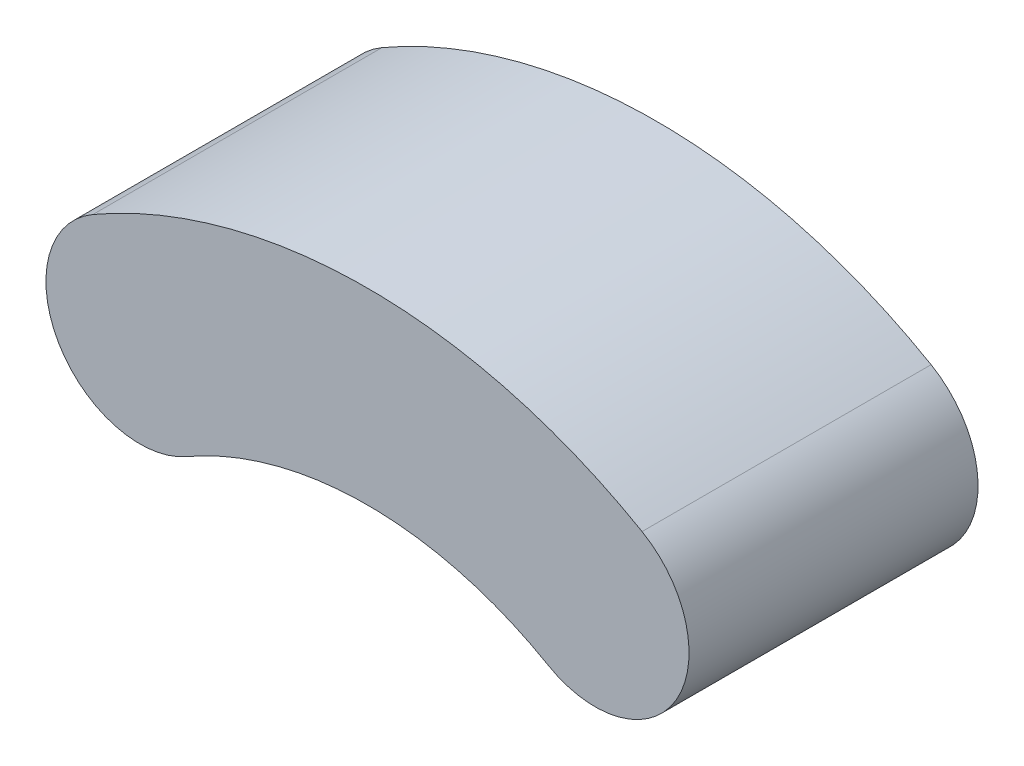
from build123d import *

# Parameters (mm, degrees)
BASE_EXTRUDE_DEPTH = 20
SKETCH2_OUTSIDE_W  = 140.952
SKETCH2_OUTSIDE_H  = 154.35
CUT_EXTRUDE2_DEPTH = 83.710491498


with BuildPart() as part:
    # Sketch1 → Base-Extrude (new body)
    with BuildSketch(Plane(origin=(0, 0, 0), x_dir=(0.8660254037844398, 0.49999999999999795, 0), z_dir=(0, 0, 1))):
        with BuildLine():
            ThreePointArc((49, 9.949874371), (43.301270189, 25), (33.11684397, 37.4603076))
            ThreePointArc((33.11684397, 37.4603076), (30, 51.961524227), (15.88315603, 47.410181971))
            ThreePointArc((15.88315603, 47.410181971), (0, 50), (-15.88315603, 47.410181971))
            ThreePointArc((-15.88315603, 47.410181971), (-30, 51.961524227), (-33.11684397, 37.4603076))
            ThreePointArc((-33.11684397, 37.4603076), (-43.301270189, 25), (-49, 9.949874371))
            ThreePointArc((-49, 9.949874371), (-60, 0), (-49, -9.949874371))
            ThreePointArc((-49, -9.949874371), (-43.301270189, -25), (-33.11684397, -37.4603076))
            ThreePointArc((-33.11684397, -37.4603076), (-30, -51.961524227), (-15.88315603, -47.410181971))
            ThreePointArc((-15.88315603, -47.410181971), (0, -50), (15.88315603, -47.410181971))
            ThreePointArc((15.88315603, -47.410181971), (30, -51.961524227), (33.11684397, -37.4603076))
            ThreePointArc((33.11684397, -37.4603076), (43.301270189, -25), (49, -9.949874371))
            ThreePointArc((49, -9.949874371), (60, 0), (49, 9.949874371))
        make_face()
    extrude(amount=BASE_EXTRUDE_DEPTH)

    # Sketch2 outside → Cut-Extrude2 (cut, through all)
    with BuildSketch(Plane.XY.offset(20)):
        Rectangle(SKETCH2_OUTSIDE_W, SKETCH2_OUTSIDE_H)
        with BuildLine():
            ThreePointArc((-19, 32.908965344), (-21.379165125, 24.029800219), (-12.5, 21.650635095))
            ThreePointArc((-12.5, 21.650635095), (0, 25), (12.5, 21.650635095))
            ThreePointArc((12.5, 21.650635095), (21.379165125, 24.029800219), (19, 32.908965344))
            ThreePointArc((19, 32.908965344), (0, 38), (-19, 32.908965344))
        make_face(mode=Mode.SUBTRACT)
    extrude(amount=-CUT_EXTRUDE2_DEPTH, mode=Mode.SUBTRACT)


solid = part.part
